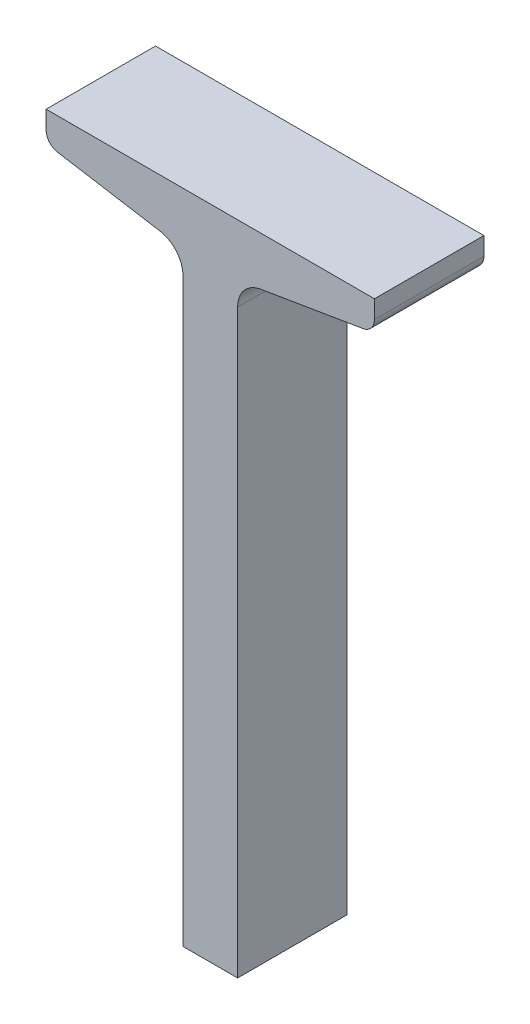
from build123d import *

# Parameters (mm, degrees)
BASESTEE_DEPTH = 12.7
TOEFILLET_R    = 3.175


with BuildPart() as part:
    # Sketch1 → BaseStee (new, symmetric)
    with BuildSketch(Plane.XY):
        with BuildLine():
            Line((0, 0), (76.2, 0))
            Line((76.2, 0), (76.2, -6.878973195))
            Line((76.2, -6.878973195), (49.755986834, -11.286630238))
            ThreePointArc((49.755986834, -11.286630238), (45.954793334, -13.445767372), (44.4499945, -17.550219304))
            Line((44.4499945, -17.550219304), (44.4499945, -152.4))
            Line((44.4499945, -152.4), (31.7500055, -152.4))
            Line((31.7500055, -152.4), (31.7500055, -17.550219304))
            ThreePointArc((31.7500055, -17.550219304), (30.245206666, -13.445767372), (26.444013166, -11.286630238))
            Line((26.444013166, -11.286630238), (0, -6.878973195))
            Line((0, -6.878973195), (0, 0))
        make_face()
    extrude(amount=BASESTEE_DEPTH, both=True)

    # ToeFillet
    toefillet_edges = [part.edges().sort_by_distance(p)[0] for p in [
        (76.2, -6.878973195, 0),
        (0, -6.878973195, 0),
    ]]
    fillet(toefillet_edges, radius=TOEFILLET_R)


solid = part.part
